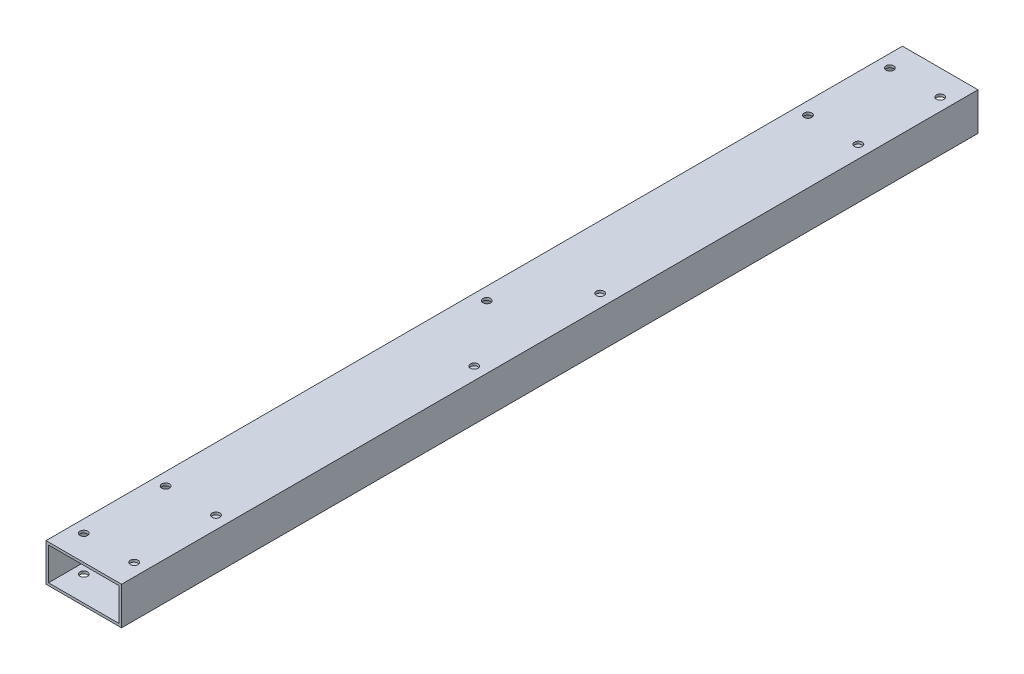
from build123d import *

# Parameters (mm, degrees)
SKETCH1_W           = 60
SKETCH1_H           = 30
SKETCH1_W_2         = 56
SKETCH1_H_2         = 26
BOSS_EXTRUDE1_DEPTH = 340
SKETCH2_R           = 3.05
CUT_EXTRUDE1_DEPTH  = 343.63683398
SKETCH3_R           = 8
CUT_EXTRUDE2_DEPTH  = 2


with BuildPart() as part:
    # Sketch1 → Boss-Extrude1 (new, symmetric)
    with BuildSketch(Plane.XY):
        Rectangle(SKETCH1_W, SKETCH1_H)
        Rectangle(SKETCH1_W_2, SKETCH1_H_2, mode=Mode.SUBTRACT)
    extrude(amount=BOSS_EXTRUDE1_DEPTH, both=True)

    # Sketch2 → Cut-Extrude1 (cut, symmetric)
    with BuildSketch(Plane(origin=(0, 15, 0), x_dir=(1, 0, 0), z_dir=(0, 1, 0))):
        with Locations(Location((-20, 320, 0), (0, 0, 90))):
            Circle(SKETCH2_R)
        with Locations(Location((20, 320, 0), (0, 0, 90))):
            Circle(SKETCH2_R)
        with Locations(Location((-20, 255, 0), (0, 0, 90))):
            Circle(SKETCH2_R)
        with Locations(Location((20, 255, 0), (0, 0, 90))):
            Circle(SKETCH2_R)
        with Locations(Location((-20, 0, 0), (0, 0, 90))):
            Circle(SKETCH2_R)
        with Locations(Location((20, 50, 0), (0, 0, 90))):
            Circle(SKETCH2_R)
    cut_extrude1 = extrude(amount=CUT_EXTRUDE1_DEPTH, both=True, mode=Mode.SUBTRACT)

    # Sketch3 → Cut-Extrude2 (cut)
    with BuildSketch(Plane(origin=(0, -15, 0), x_dir=(1, 0, 0), z_dir=(0, 1, 0))):
        with Locations((20, 255)):
            Circle(SKETCH3_R)
        with Locations(Location((-20, 255, 0), (0, 0, 180))):
            Circle(SKETCH3_R)
        with Locations((20, 50)):
            Circle(SKETCH3_R)
        with Locations(Location((-20, 0, 0), (0, 0, 180))):
            Circle(SKETCH3_R)
    cut_extrude2 = extrude(amount=CUT_EXTRUDE2_DEPTH, mode=Mode.SUBTRACT)

    # Mirror1: Cut-Extrude1, Cut-Extrude2 across plane
    add(cut_extrude1.mirror(Plane.XY), mode=Mode.SUBTRACT)
    add(cut_extrude2.mirror(Plane.XY), mode=Mode.SUBTRACT)


solid = part.part
